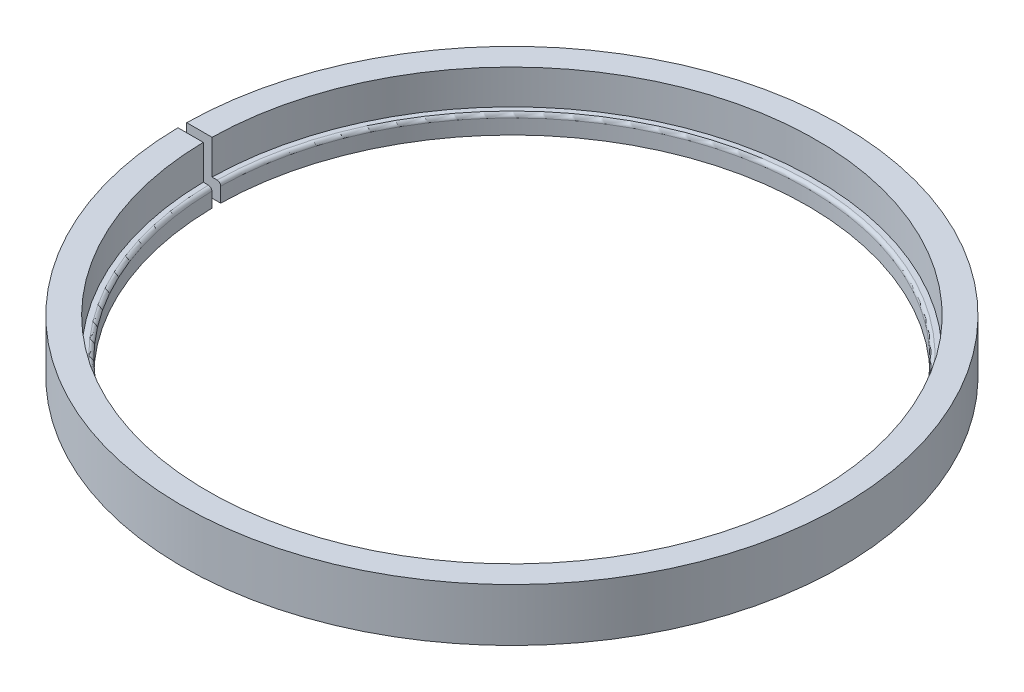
ISO-10303-21;
HEADER;
FILE_DESCRIPTION(('STEP AP214'),'2;1');
FILE_NAME('part.step','',(''),(''),'','','');
FILE_SCHEMA(('AUTOMOTIVE_DESIGN { 1 0 10303 214 1 1 1 1 }'));
ENDSEC;
DATA;
#1=APPLICATION_CONTEXT('core data for automotive mechanical design processes');
#2=APPLICATION_PROTOCOL_DEFINITION('international standard','automotive_design',2000,#1);
#3=PRODUCT_CONTEXT('',#1,'mechanical');
#4=PRODUCT('Part','Part','',(#3));
#5=PRODUCT_RELATED_PRODUCT_CATEGORY('part','',(#4));
#6=PRODUCT_DEFINITION_FORMATION('','',#4);
#7=PRODUCT_DEFINITION_CONTEXT('part definition',#1,'design');
#8=PRODUCT_DEFINITION('design','',#6,#7);
#9=PRODUCT_DEFINITION_SHAPE('','',#8);
#10=(LENGTH_UNIT() NAMED_UNIT(*) SI_UNIT(.MILLI.,.METRE.));
#11=(NAMED_UNIT(*) PLANE_ANGLE_UNIT() SI_UNIT($,.RADIAN.));
#12=(NAMED_UNIT(*) SI_UNIT($,.STERADIAN.) SOLID_ANGLE_UNIT());
#13=UNCERTAINTY_MEASURE_WITH_UNIT(LENGTH_MEASURE(1.E-05),#10,'distance_accuracy_value','');
#14=(GEOMETRIC_REPRESENTATION_CONTEXT(3) GLOBAL_UNCERTAINTY_ASSIGNED_CONTEXT((#13)) GLOBAL_UNIT_ASSIGNED_CONTEXT((#10,
#11,#12)) REPRESENTATION_CONTEXT('',''));
#15=CARTESIAN_POINT('',(0.,0.,0.));
#16=DIRECTION('',(0.,0.,1.));
#17=DIRECTION('',(1.,0.,0.));
#18=AXIS2_PLACEMENT_3D('',#15,#16,#17);
#19=CARTESIAN_POINT('',(0.,0.,0.));
#20=DIRECTION('',(0.,-1.,0.));
#21=DIRECTION('',(0.,0.,-1.));
#22=AXIS2_PLACEMENT_3D('',#19,#20,#21);
#23=CYLINDRICAL_SURFACE('',#22,106.6927);
#24=CARTESIAN_POINT('',(0.,6.09600000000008,0.));
#25=DIRECTION('',(0.,-1.,0.));
#26=DIRECTION('',(0.,0.,-1.));
#27=AXIS2_PLACEMENT_3D('',#24,#25,#26);
#28=CIRCLE('',#27,106.6927);
#29=CARTESIAN_POINT('',(-106.680888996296,6.09600000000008,-1.5875));
#30=VERTEX_POINT('',#29);
#31=CARTESIAN_POINT('',(-106.680888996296,6.09600000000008,1.5875));
#32=VERTEX_POINT('',#31);
#33=EDGE_CURVE('E129',#30,#32,#28,.T.);
#34=ORIENTED_EDGE('',*,*,#33,.T.);
#35=DIRECTION('',(0.,-1.,0.));
#36=VECTOR('',#35,1.);
#37=CARTESIAN_POINT('',(-106.680888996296,0.,1.5875));
#38=LINE('',#37,#36);
#39=CARTESIAN_POINT('',(-106.680888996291,11.4299999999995,1.5875));
#40=VERTEX_POINT('',#39);
#41=EDGE_CURVE('E155',#32,#40,#38,.F.);
#42=ORIENTED_EDGE('',*,*,#41,.T.);
#43=CARTESIAN_POINT('',(0.,11.43,0.));
#44=DIRECTION('',(0.,-1.,0.));
#45=DIRECTION('',(0.,0.,-1.));
#46=AXIS2_PLACEMENT_3D('',#43,#44,#45);
#47=CIRCLE('',#46,106.6927);
#48=CARTESIAN_POINT('',(-106.680888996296,11.43,-1.5875));
#49=VERTEX_POINT('',#48);
#50=EDGE_CURVE('E176',#49,#40,#47,.T.);
#51=ORIENTED_EDGE('',*,*,#50,.F.);
#52=DIRECTION('',(0.,-1.,0.));
#53=VECTOR('',#52,1.);
#54=CARTESIAN_POINT('',(-106.680888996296,0.,-1.5875));
#55=LINE('',#54,#53);
#56=EDGE_CURVE('E53',#49,#30,#55,.T.);
#57=ORIENTED_EDGE('',*,*,#56,.T.);
#58=EDGE_LOOP('',(#34,#42,#51,#57));
#59=FACE_BOUND('',#58,.T.);
#60=ADVANCED_FACE('F35',(#59),#23,.F.);
#61=CARTESIAN_POINT('',(-118.935499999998,6.09600000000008,0.));
#62=DIRECTION('',(0.,1.,0.));
#63=DIRECTION('',(0.,0.,1.));
#64=AXIS2_PLACEMENT_3D('',#61,#62,#63);
#65=PLANE('',#64);
#66=CARTESIAN_POINT('',(0.,6.09600000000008,0.));
#67=DIRECTION('',(0.,-1.,0.));
#68=DIRECTION('',(0.,0.,-1.));
#69=AXIS2_PLACEMENT_3D('',#66,#67,#68);
#70=CIRCLE('',#69,118.935499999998);
#71=CARTESIAN_POINT('',(-118.924904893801,6.09600000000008,-1.5875));
#72=VERTEX_POINT('',#71);
#73=CARTESIAN_POINT('',(-118.924904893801,6.09600000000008,1.5875));
#74=VERTEX_POINT('',#73);
#75=EDGE_CURVE('E121',#72,#74,#70,.T.);
#76=ORIENTED_EDGE('',*,*,#75,.T.);
#77=DIRECTION('',(1.,0.,0.));
#78=VECTOR('',#77,1.);
#79=CARTESIAN_POINT('',(-135.057163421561,6.09600000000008,1.5875));
#80=LINE('',#79,#78);
#81=EDGE_CURVE('E161',#74,#32,#80,.T.);
#82=ORIENTED_EDGE('',*,*,#81,.T.);
#83=ORIENTED_EDGE('',*,*,#33,.F.);
#84=DIRECTION('',(-1.,0.,0.));
#85=VECTOR('',#84,1.);
#86=CARTESIAN_POINT('',(-135.057163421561,6.09600000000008,-1.5875));
#87=LINE('',#86,#85);
#88=EDGE_CURVE('E159',#30,#72,#87,.T.);
#89=ORIENTED_EDGE('',*,*,#88,.T.);
#90=EDGE_LOOP('',(#76,#82,#83,#89));
#91=FACE_BOUND('',#90,.T.);
#92=ADVANCED_FACE('F145',(#91),#65,.F.);
#93=CARTESIAN_POINT('',(0.,0.,0.));
#94=DIRECTION('',(0.,-1.,0.));
#95=DIRECTION('',(0.,0.,-1.));
#96=AXIS2_PLACEMENT_3D('',#93,#94,#95);
#97=CYLINDRICAL_SURFACE('',#96,118.935499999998);
#98=CARTESIAN_POINT('',(0.,25.1460000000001,0.));
#99=DIRECTION('',(0.,-1.,0.));
#100=DIRECTION('',(0.,0.,-1.));
#101=AXIS2_PLACEMENT_3D('',#98,#99,#100);
#102=CIRCLE('',#101,118.935499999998);
#103=CARTESIAN_POINT('',(-118.924904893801,25.1460000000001,-1.5875));
#104=VERTEX_POINT('',#103);
#105=CARTESIAN_POINT('',(-118.924904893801,25.1460000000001,1.5875));
#106=VERTEX_POINT('',#105);
#107=EDGE_CURVE('E113',#104,#106,#102,.T.);
#108=ORIENTED_EDGE('',*,*,#107,.T.);
#109=DIRECTION('',(0.,-1.,0.));
#110=VECTOR('',#109,1.);
#111=CARTESIAN_POINT('',(-118.924904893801,0.,1.5875));
#112=LINE('',#111,#110);
#113=EDGE_CURVE('E174',#106,#74,#112,.T.);
#114=ORIENTED_EDGE('',*,*,#113,.T.);
#115=ORIENTED_EDGE('',*,*,#75,.F.);
#116=DIRECTION('',(0.,-1.,0.));
#117=VECTOR('',#116,1.);
#118=CARTESIAN_POINT('',(-118.924904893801,0.,-1.5875));
#119=LINE('',#118,#117);
#120=EDGE_CURVE('E169',#72,#104,#119,.F.);
#121=ORIENTED_EDGE('',*,*,#120,.T.);
#122=EDGE_LOOP('',(#108,#114,#115,#121));
#123=FACE_BOUND('',#122,.T.);
#124=ADVANCED_FACE('F150',(#123),#97,.T.);
#125=CARTESIAN_POINT('',(-118.935499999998,25.1460000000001,0.));
#126=DIRECTION('',(0.,-1.,0.));
#127=DIRECTION('',(0.,0.,-1.));
#128=AXIS2_PLACEMENT_3D('',#125,#126,#127);
#129=PLANE('',#128);
#130=CARTESIAN_POINT('',(0.,25.1460000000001,0.));
#131=DIRECTION('',(0.,-1.,0.));
#132=DIRECTION('',(0.,0.,-1.));
#133=AXIS2_PLACEMENT_3D('',#130,#131,#132);
#134=CIRCLE('',#133,109.791499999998);
#135=CARTESIAN_POINT('',(-109.780022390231,25.1460000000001,-1.5875));
#136=VERTEX_POINT('',#135);
#137=CARTESIAN_POINT('',(-109.780022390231,25.1460000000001,1.5875));
#138=VERTEX_POINT('',#137);
#139=EDGE_CURVE('E111',#136,#138,#134,.T.);
#140=ORIENTED_EDGE('',*,*,#139,.T.);
#141=DIRECTION('',(1.,0.,0.));
#142=VECTOR('',#141,1.);
#143=CARTESIAN_POINT('',(-135.057163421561,25.1460000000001,1.5875));
#144=LINE('',#143,#142);
#145=EDGE_CURVE('E114',#106,#138,#144,.T.);
#146=ORIENTED_EDGE('',*,*,#145,.F.);
#147=ORIENTED_EDGE('',*,*,#107,.F.);
#148=DIRECTION('',(-1.,0.,0.));
#149=VECTOR('',#148,1.);
#150=CARTESIAN_POINT('',(-135.057163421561,25.1460000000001,-1.5875));
#151=LINE('',#150,#149);
#152=EDGE_CURVE('E97',#136,#104,#151,.T.);
#153=ORIENTED_EDGE('',*,*,#152,.F.);
#154=EDGE_LOOP('',(#140,#146,#147,#153));
#155=FACE_BOUND('',#154,.T.);
#156=ADVANCED_FACE('F109',(#155),#129,.F.);
#157=CARTESIAN_POINT('',(0.,0.,0.));
#158=DIRECTION('',(0.,-1.,0.));
#159=DIRECTION('',(0.,0.,-1.));
#160=AXIS2_PLACEMENT_3D('',#157,#158,#159);
#161=CYLINDRICAL_SURFACE('',#160,109.791499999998);
#162=CARTESIAN_POINT('',(0.,12.7,0.));
#163=DIRECTION('',(0.,-1.,0.));
#164=DIRECTION('',(0.,0.,-1.));
#165=AXIS2_PLACEMENT_3D('',#162,#163,#164);
#166=CIRCLE('',#165,109.791499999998);
#167=CARTESIAN_POINT('',(-109.780022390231,12.7,-1.5875));
#168=VERTEX_POINT('',#167);
#169=CARTESIAN_POINT('',(-109.780022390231,12.7,1.5875));
#170=VERTEX_POINT('',#169);
#171=EDGE_CURVE('E119',#168,#170,#166,.T.);
#172=ORIENTED_EDGE('',*,*,#171,.T.);
#173=DIRECTION('',(0.,-1.,0.));
#174=VECTOR('',#173,1.);
#175=CARTESIAN_POINT('',(-109.780022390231,0.,1.5875));
#176=LINE('',#175,#174);
#177=EDGE_CURVE('E118',#170,#138,#176,.F.);
#178=ORIENTED_EDGE('',*,*,#177,.T.);
#179=ORIENTED_EDGE('',*,*,#139,.F.);
#180=DIRECTION('',(0.,-1.,0.));
#181=VECTOR('',#180,1.);
#182=CARTESIAN_POINT('',(-109.780022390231,0.,-1.5875));
#183=LINE('',#182,#181);
#184=EDGE_CURVE('E94',#136,#168,#183,.T.);
#185=ORIENTED_EDGE('',*,*,#184,.T.);
#186=EDGE_LOOP('',(#172,#178,#179,#185));
#187=FACE_BOUND('',#186,.T.);
#188=ADVANCED_FACE('F117',(#187),#161,.F.);
#189=CARTESIAN_POINT('',(-109.791499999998,12.7,0.));
#190=DIRECTION('',(0.,-1.,0.));
#191=DIRECTION('',(0.,0.,-1.));
#192=AXIS2_PLACEMENT_3D('',#189,#190,#191);
#193=PLANE('',#192);
#194=CARTESIAN_POINT('',(0.,12.7,0.));
#195=DIRECTION('',(0.,-1.,0.));
#196=DIRECTION('',(0.,0.,-1.));
#197=AXIS2_PLACEMENT_3D('',#194,#195,#196);
#198=CIRCLE('',#197,107.9627);
#199=CARTESIAN_POINT('',(-107.951027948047,12.7000000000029,-1.5875));
#200=VERTEX_POINT('',#199);
#201=CARTESIAN_POINT('',(-107.951027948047,12.7,1.5875));
#202=VERTEX_POINT('',#201);
#203=EDGE_CURVE('E123',#200,#202,#198,.T.);
#204=ORIENTED_EDGE('',*,*,#203,.T.);
#205=DIRECTION('',(-1.,0.,0.));
#206=VECTOR('',#205,1.);
#207=CARTESIAN_POINT('',(-109.791499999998,12.7,1.5875));
#208=LINE('',#207,#206);
#209=EDGE_CURVE('E61',#202,#170,#208,.T.);
#210=ORIENTED_EDGE('',*,*,#209,.T.);
#211=ORIENTED_EDGE('',*,*,#171,.F.);
#212=DIRECTION('',(1.,0.,0.));
#213=VECTOR('',#212,1.);
#214=CARTESIAN_POINT('',(-109.791499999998,12.7,-1.5875));
#215=LINE('',#214,#213);
#216=EDGE_CURVE('E100',#168,#200,#215,.T.);
#217=ORIENTED_EDGE('',*,*,#216,.T.);
#218=EDGE_LOOP('',(#204,#210,#211,#217));
#219=FACE_BOUND('',#218,.T.);
#220=ADVANCED_FACE('F180',(#219),#193,.F.);
#221=CARTESIAN_POINT('',(0.,11.43,0.));
#222=DIRECTION('',(0.,-1.,0.));
#223=DIRECTION('',(0.,0.,-1.));
#224=AXIS2_PLACEMENT_3D('',#221,#222,#223);
#225=TOROIDAL_SURFACE('',#224,107.9627,1.27);
#226=ORIENTED_EDGE('',*,*,#50,.T.);
#227=CARTESIAN_POINT('',(-107.397596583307,12.5731011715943,1.5875));
#228=CARTESIAN_POINT('',(-107.461820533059,12.6041848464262,1.5875));
#229=CARTESIAN_POINT('',(-107.528716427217,12.6298672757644,1.5875));
#230=CARTESIAN_POINT('',(-107.665926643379,12.6696563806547,1.5875));
#231=CARTESIAN_POINT('',(-107.736244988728,12.6837490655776,1.5875));
#232=CARTESIAN_POINT('',(-107.878222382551,12.6999210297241,1.5875));
#233=CARTESIAN_POINT('',(-107.949880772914,12.7020060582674,1.5875));
#234=CARTESIAN_POINT('',(-108.09251076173,12.6941150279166,1.5875));
#235=CARTESIAN_POINT('',(-108.163482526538,12.6841419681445,1.5875));
#236=CARTESIAN_POINT('',(-108.302753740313,12.6524220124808,1.5875));
#237=CARTESIAN_POINT('',(-108.371052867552,12.6306737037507,1.5875));
#238=CARTESIAN_POINT('',(-108.503032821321,12.576017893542,1.5875));
#239=CARTESIAN_POINT('',(-108.566713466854,12.5431099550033,1.5875));
#240=CARTESIAN_POINT('',(-108.687641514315,12.467071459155,1.5875));
#241=CARTESIAN_POINT('',(-108.744889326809,12.4239415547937,1.5875));
#242=CARTESIAN_POINT('',(-108.851330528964,12.3286820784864,1.5875));
#243=CARTESIAN_POINT('',(-108.900523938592,12.2765525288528,1.5875));
#244=CARTESIAN_POINT('',(-108.989455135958,12.1647785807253,1.5875));
#245=CARTESIAN_POINT('',(-109.029193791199,12.1051348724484,1.5875));
#246=CARTESIAN_POINT('',(-109.098092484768,11.9800220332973,1.5875));
#247=CARTESIAN_POINT('',(-109.127252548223,11.9145529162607,1.5875));
#248=CARTESIAN_POINT('',(-109.174163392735,11.7796547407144,1.5875));
#249=CARTESIAN_POINT('',(-109.191915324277,11.7102260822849,1.5875));
#250=CARTESIAN_POINT('',(-109.215510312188,11.5693737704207,1.5875));
#251=CARTESIAN_POINT('',(-109.22135336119,11.4979501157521,1.5875));
#252=CARTESIAN_POINT('',(-109.220964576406,11.355140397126,1.5875));
#253=CARTESIAN_POINT('',(-109.214733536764,11.2837543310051,1.5875));
#254=CARTESIAN_POINT('',(-109.190375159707,11.1430415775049,1.5875));
#255=CARTESIAN_POINT('',(-109.172247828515,11.0737148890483,1.5875));
#256=CARTESIAN_POINT('',(-109.124611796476,10.9390888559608,1.5875));
#257=CARTESIAN_POINT('',(-109.095103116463,10.8737895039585,1.5875));
#258=CARTESIAN_POINT('',(-109.025542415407,10.7490712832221,1.5875));
#259=CARTESIAN_POINT('',(-108.985490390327,10.6896524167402,1.5875));
#260=CARTESIAN_POINT('',(-108.895977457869,10.5783778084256,1.5875));
#261=CARTESIAN_POINT('',(-108.846515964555,10.5265225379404,1.5875));
#262=CARTESIAN_POINT('',(-108.739590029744,10.431850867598,1.5875));
#263=CARTESIAN_POINT('',(-108.68212558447,10.3890344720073,1.5875));
#264=CARTESIAN_POINT('',(-108.560818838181,10.3136513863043,1.5875));
#265=CARTESIAN_POINT('',(-108.496975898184,10.2810857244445,1.5875));
#266=CARTESIAN_POINT('',(-108.364729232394,10.2271337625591,1.5875));
#267=CARTESIAN_POINT('',(-108.29632550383,10.2057474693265,1.5875));
#268=CARTESIAN_POINT('',(-108.156892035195,10.1747593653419,1.5875));
#269=CARTESIAN_POINT('',(-108.085862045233,10.1651586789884,1.5875));
#270=CARTESIAN_POINT('',(-107.943198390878,10.1580178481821,1.5875));
#271=CARTESIAN_POINT('',(-107.871564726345,10.1604777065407,1.5875));
#272=CARTESIAN_POINT('',(-107.72972350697,10.1773885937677,1.5875));
#273=CARTESIAN_POINT('',(-107.659516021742,10.19184020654,1.5875));
#274=CARTESIAN_POINT('',(-107.522523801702,10.2323253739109,1.5875));
#275=CARTESIAN_POINT('',(-107.455739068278,10.2583589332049,1.5875));
#276=CARTESIAN_POINT('',(-107.3274897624,10.321268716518,1.5875));
#277=CARTESIAN_POINT('',(-107.266025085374,10.358144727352,1.5875));
#278=CARTESIAN_POINT('',(-107.150159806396,10.4416931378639,1.5875));
#279=CARTESIAN_POINT('',(-107.09575919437,10.4883655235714,1.5875));
#280=CARTESIAN_POINT('',(-106.995571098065,10.5901778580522,1.5875));
#281=CARTESIAN_POINT('',(-106.949782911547,10.6453171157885,1.5875));
#282=CARTESIAN_POINT('',(-106.868114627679,10.7625009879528,1.5875));
#283=CARTESIAN_POINT('',(-106.832234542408,10.8245456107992,1.5875));
#284=CARTESIAN_POINT('',(-106.771405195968,10.9537716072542,1.5875));
#285=CARTESIAN_POINT('',(-106.746454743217,11.0209524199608,1.5875));
#286=CARTESIAN_POINT('',(-106.708187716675,11.1585496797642,1.5875));
#287=CARTESIAN_POINT('',(-106.694871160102,11.2289661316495,1.5875));
#288=CARTESIAN_POINT('',(-106.680250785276,11.3710304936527,1.5875));
#289=CARTESIAN_POINT('',(-106.67894616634,11.4426783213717,1.5875));
#290=CARTESIAN_POINT('',(-106.688384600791,11.585173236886,1.5875));
#291=CARTESIAN_POINT('',(-106.699127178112,11.6560203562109,1.5875));
#292=CARTESIAN_POINT('',(-106.732351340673,11.7948962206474,1.5875));
#293=CARTESIAN_POINT('',(-106.754831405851,11.8629253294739,1.5875));
#294=CARTESIAN_POINT('',(-106.810900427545,11.9942621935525,1.5875));
#295=CARTESIAN_POINT('',(-106.844492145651,12.0575687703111,1.5875));
#296=CARTESIAN_POINT('',(-106.921841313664,12.1776714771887,1.5875));
#297=CARTESIAN_POINT('',(-106.965604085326,12.2344641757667,1.5875));
#298=CARTESIAN_POINT('',(-107.062013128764,12.3398420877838,1.5875));
#299=CARTESIAN_POINT('',(-107.114648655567,12.3884370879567,1.5875));
#300=CARTESIAN_POINT('',(-107.20611707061,12.4596212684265,1.5875));
#301=CARTESIAN_POINT('',(-107.242720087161,12.485127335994,1.5875));
#302=CARTESIAN_POINT('',(-107.318400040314,12.5321585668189,1.5875));
#303=CARTESIAN_POINT('',(-107.357476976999,12.5536837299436,1.5875));
#304=CARTESIAN_POINT('',(-107.397596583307,12.5731011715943,1.5875));
#305=B_SPLINE_CURVE_WITH_KNOTS('',3,(#227,#228,#229,#230,#231,#232,#233,#234,#235,#236,#237,
#238,#239,#240,#241,#242,#243,#244,#245,#246,#247,#248,#249,#250,#251,#252,#253,#254,#255,#256,
#257,#258,#259,#260,#261,#262,#263,#264,#265,#266,#267,#268,#269,#270,#271,#272,#273,#274,#275,
#276,#277,#278,#279,#280,#281,#282,#283,#284,#285,#286,#287,#288,#289,#290,#291,#292,#293,#294,
#295,#296,#297,#298,#299,#300,#301,#302,#303,#304),.UNSPECIFIED.,.T.,.F.,(4,2,2,2,2,2,2,2,2,2,2,
2,2,2,2,2,2,2,2,2,2,2,2,2,2,2,2,2,2,2,2,2,2,2,2,2,2,2,4),(0.,0.213889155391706,
0.428036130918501,0.642080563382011,0.856071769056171,1.07008865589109,1.28411392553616,
1.49812552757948,1.71213659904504,1.92612802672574,2.14011894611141,2.35408828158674,
2.56805774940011,2.78201314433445,2.99596842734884,3.20992331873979,3.42387829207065,
3.63784659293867,3.8518149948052,4.06580485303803,4.27979484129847,4.49380524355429,
4.70781569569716,4.92183656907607,5.13585752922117,5.3498742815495,5.56389072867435,
5.77788971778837,5.99188896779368,6.20586488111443,6.41984111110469,6.63380307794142,
6.84775659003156,7.06168240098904,7.27566141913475,7.48975264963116,7.7035864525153,
7.83719935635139,7.97081226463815),.UNSPECIFIED.);
#306=EDGE_CURVE('E11',#40,#202,#305,.T.);
#307=ORIENTED_EDGE('',*,*,#306,.T.);
#308=ORIENTED_EDGE('',*,*,#203,.F.);
#309=CARTESIAN_POINT('',(-107.397596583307,12.5731011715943,-1.5875));
#310=CARTESIAN_POINT('',(-107.333383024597,12.5420154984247,-1.5875));
#311=CARTESIAN_POINT('',(-107.271747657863,12.505484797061,-1.5875));
#312=CARTESIAN_POINT('',(-107.155434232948,12.4225626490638,-1.5875));
#313=CARTESIAN_POINT('',(-107.100764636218,12.3761593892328,-1.5875));
#314=CARTESIAN_POINT('',(-107.000014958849,12.2748490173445,-1.5875));
#315=CARTESIAN_POINT('',(-106.953930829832,12.2199459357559,-1.5875));
#316=CARTESIAN_POINT('',(-106.871648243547,12.1031963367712,-1.5875));
#317=CARTESIAN_POINT('',(-106.835447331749,12.041351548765,-1.5875));
#318=CARTESIAN_POINT('',(-106.773940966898,11.9124601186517,-1.5875));
#319=CARTESIAN_POINT('',(-106.748635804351,11.8454133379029,-1.5875));
#320=CARTESIAN_POINT('',(-106.709641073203,11.7080202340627,-1.5875));
#321=CARTESIAN_POINT('',(-106.695951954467,11.6376737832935,-1.5875));
#322=CARTESIAN_POINT('',(-106.680580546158,11.4956885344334,-1.5875));
#323=CARTESIAN_POINT('',(-106.678897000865,11.4240498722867,-1.5875));
#324=CARTESIAN_POINT('',(-106.687581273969,11.281506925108,-1.5875));
#325=CARTESIAN_POINT('',(-106.697949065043,11.2106026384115,-1.5875));
#326=CARTESIAN_POINT('',(-106.730441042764,11.0715427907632,-1.5875));
#327=CARTESIAN_POINT('',(-106.752564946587,11.0033871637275,-1.5875));
#328=CARTESIAN_POINT('',(-106.80794054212,10.8717574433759,-1.5875));
#329=CARTESIAN_POINT('',(-106.841192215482,10.8082833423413,-1.5875));
#330=CARTESIAN_POINT('',(-106.917880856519,10.687815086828,-1.5875));
#331=CARTESIAN_POINT('',(-106.961318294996,10.6308212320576,-1.5875));
#332=CARTESIAN_POINT('',(-107.057144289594,10.5249340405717,-1.5875));
#333=CARTESIAN_POINT('',(-107.109532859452,10.4760407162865,-1.5875));
#334=CARTESIAN_POINT('',(-107.221779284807,10.3877374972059,-1.5875));
#335=CARTESIAN_POINT('',(-107.281637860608,10.3483285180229,-1.5875));
#336=CARTESIAN_POINT('',(-107.407121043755,10.2801181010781,-1.5875));
#337=CARTESIAN_POINT('',(-107.472745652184,10.2513166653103,-1.5875));
#338=CARTESIAN_POINT('',(-107.607905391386,10.2051358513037,-1.5875));
#339=CARTESIAN_POINT('',(-107.677440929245,10.1877576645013,-1.5875));
#340=CARTESIAN_POINT('',(-107.818442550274,10.1649211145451,-1.5875));
#341=CARTESIAN_POINT('',(-107.889908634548,10.1594627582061,-1.5875));
#342=CARTESIAN_POINT('',(-108.032747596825,10.1606207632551,-1.5875));
#343=CARTESIAN_POINT('',(-108.104120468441,10.1672379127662,-1.5875));
#344=CARTESIAN_POINT('',(-108.244742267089,10.1923607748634,-1.5875));
#345=CARTESIAN_POINT('',(-108.313991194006,10.2108664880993,-1.5875));
#346=CARTESIAN_POINT('',(-108.448399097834,10.2592414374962,-1.5875));
#347=CARTESIAN_POINT('',(-108.513558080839,10.2891106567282,-1.5875));
#348=CARTESIAN_POINT('',(-108.637936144,10.3593651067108,-1.5875));
#349=CARTESIAN_POINT('',(-108.697155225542,10.3997503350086,-1.5875));
#350=CARTESIAN_POINT('',(-108.807968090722,10.4898876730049,-1.5875));
#351=CARTESIAN_POINT('',(-108.859562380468,10.5396391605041,-1.5875));
#352=CARTESIAN_POINT('',(-108.953665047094,10.6470987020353,-1.5875));
#353=CARTESIAN_POINT('',(-108.996173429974,10.7048067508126,-1.5875));
#354=CARTESIAN_POINT('',(-109.070892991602,10.8265349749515,-1.5875));
#355=CARTESIAN_POINT('',(-109.103105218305,10.8905545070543,-1.5875));
#356=CARTESIAN_POINT('',(-109.156323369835,11.023093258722,-1.5875));
#357=CARTESIAN_POINT('',(-109.177329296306,11.0916124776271,-1.5875));
#358=CARTESIAN_POINT('',(-109.207536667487,11.2311987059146,-1.5875));
#359=CARTESIAN_POINT('',(-109.216739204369,11.3022654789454,-1.5875));
#360=CARTESIAN_POINT('',(-109.223081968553,11.4449352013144,-1.5875));
#361=CARTESIAN_POINT('',(-109.22022221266,11.5165381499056,-1.5875));
#362=CARTESIAN_POINT('',(-109.202522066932,11.6582443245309,-1.5875));
#363=CARTESIAN_POINT('',(-109.187682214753,11.7283476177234,-1.5875));
#364=CARTESIAN_POINT('',(-109.14644402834,11.8650680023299,-1.5875));
#365=CARTESIAN_POINT('',(-109.12004567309,11.9316850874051,-1.5875));
#366=CARTESIAN_POINT('',(-109.056439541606,12.0595434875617,-1.5875));
#367=CARTESIAN_POINT('',(-109.019231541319,12.1207846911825,-1.5875));
#368=CARTESIAN_POINT('',(-108.935062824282,12.2361519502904,-1.5875));
#369=CARTESIAN_POINT('',(-108.888102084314,12.2902779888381,-1.5875));
#370=CARTESIAN_POINT('',(-108.785756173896,12.3898839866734,-1.5875));
#371=CARTESIAN_POINT('',(-108.73037017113,12.4353630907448,-1.5875));
#372=CARTESIAN_POINT('',(-108.612751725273,12.5163765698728,-1.5875));
#373=CARTESIAN_POINT('',(-108.550519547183,12.5519113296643,-1.5875));
#374=CARTESIAN_POINT('',(-108.420974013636,12.6120307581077,-1.5875));
#375=CARTESIAN_POINT('',(-108.353660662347,12.6366154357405,-1.5875));
#376=CARTESIAN_POINT('',(-108.215843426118,12.6741413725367,-1.5875));
#377=CARTESIAN_POINT('',(-108.145338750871,12.6870797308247,-1.5875));
#378=CARTESIAN_POINT('',(-108.003124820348,12.7009424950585,-1.5875));
#379=CARTESIAN_POINT('',(-107.931414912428,12.7018601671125,-1.5875));
#380=CARTESIAN_POINT('',(-107.78892015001,12.6916324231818,-1.5875));
#381=CARTESIAN_POINT('',(-107.718134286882,12.6805015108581,-1.5875));
#382=CARTESIAN_POINT('',(-107.605513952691,12.6529225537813,-1.5875));
#383=CARTESIAN_POINT('',(-107.562775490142,12.640032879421,-1.5875));
#384=CARTESIAN_POINT('',(-107.478887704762,12.6098384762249,-1.5875));
#385=CARTESIAN_POINT('',(-107.437738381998,12.5925337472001,-1.5875));
#386=CARTESIAN_POINT('',(-107.397596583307,12.5731011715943,-1.5875));
#387=B_SPLINE_CURVE_WITH_KNOTS('',3,(#309,#310,#311,#312,#313,#314,#315,#316,#317,#318,#319,
#320,#321,#322,#323,#324,#325,#326,#327,#328,#329,#330,#331,#332,#333,#334,#335,#336,#337,#338,
#339,#340,#341,#342,#343,#344,#345,#346,#347,#348,#349,#350,#351,#352,#353,#354,#355,#356,#357,
#358,#359,#360,#361,#362,#363,#364,#365,#366,#367,#368,#369,#370,#371,#372,#373,#374,#375,#376,
#377,#378,#379,#380,#381,#382,#383,#384,#385,#386),.UNSPECIFIED.,.T.,.F.,(4,2,2,2,2,2,2,2,2,2,2,
2,2,2,2,2,2,2,2,2,2,2,2,2,2,2,2,2,2,2,2,2,2,2,2,2,2,2,4),(0.,0.213863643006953,
0.427984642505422,0.642004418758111,0.855970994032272,1.06994327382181,1.28392383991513,
1.49788202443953,1.71183972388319,1.9257922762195,2.13974447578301,2.35370656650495,
2.56766898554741,2.78165205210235,2.99563515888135,3.20964058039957,3.42364612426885,
3.63766563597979,3.85168515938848,4.06570436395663,4.27972351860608,4.49372846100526,
4.70773326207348,4.92171627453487,5.13569925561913,5.34966243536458,5.56362531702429,
5.77757859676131,5.99153226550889,6.20549036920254,6.41944898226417,6.63342874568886,
6.84740022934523,7.06137153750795,7.27539612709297,7.48954060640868,7.70342759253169,
7.83712008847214,7.97081259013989),.UNSPECIFIED.);
#388=EDGE_CURVE('E46',#200,#49,#387,.T.);
#389=ORIENTED_EDGE('',*,*,#388,.T.);
#390=EDGE_LOOP('',(#226,#307,#308,#389));
#391=FACE_BOUND('',#390,.T.);
#392=ADVANCED_FACE('F134',(#391),#225,.T.);
#393=CARTESIAN_POINT('',(-135.057163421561,6.09600000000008,-1.5875));
#394=DIRECTION('',(0.,0.,-1.));
#395=DIRECTION('',(-1.,0.,0.));
#396=AXIS2_PLACEMENT_3D('',#393,#394,#395);
#397=PLANE('',#396);
#398=ORIENTED_EDGE('',*,*,#88,.F.);
#399=ORIENTED_EDGE('',*,*,#56,.F.);
#400=ORIENTED_EDGE('',*,*,#388,.F.);
#401=ORIENTED_EDGE('',*,*,#216,.F.);
#402=ORIENTED_EDGE('',*,*,#184,.F.);
#403=ORIENTED_EDGE('',*,*,#152,.T.);
#404=ORIENTED_EDGE('',*,*,#120,.F.);
#405=EDGE_LOOP('',(#398,#399,#400,#401,#402,#403,#404));
#406=FACE_BOUND('',#405,.T.);
#407=ADVANCED_FACE('F96',(#406),#397,.F.);
#408=CARTESIAN_POINT('',(-135.057163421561,6.09600000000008,1.5875));
#409=DIRECTION('',(0.,0.,1.));
#410=DIRECTION('',(1.,0.,0.));
#411=AXIS2_PLACEMENT_3D('',#408,#409,#410);
#412=PLANE('',#411);
#413=ORIENTED_EDGE('',*,*,#145,.T.);
#414=ORIENTED_EDGE('',*,*,#177,.F.);
#415=ORIENTED_EDGE('',*,*,#209,.F.);
#416=ORIENTED_EDGE('',*,*,#306,.F.);
#417=ORIENTED_EDGE('',*,*,#41,.F.);
#418=ORIENTED_EDGE('',*,*,#81,.F.);
#419=ORIENTED_EDGE('',*,*,#113,.F.);
#420=EDGE_LOOP('',(#413,#414,#415,#416,#417,#418,#419));
#421=FACE_BOUND('',#420,.T.);
#422=ADVANCED_FACE('F139',(#421),#412,.F.);
#423=CLOSED_SHELL('',(#60,#92,#124,#156,#188,#220,#392,#407,#422));
#424=MANIFOLD_SOLID_BREP('B2',#423);
#425=ADVANCED_BREP_SHAPE_REPRESENTATION('',(#18,#424),#14);
#426=SHAPE_DEFINITION_REPRESENTATION(#9,#425);
ENDSEC;
END-ISO-10303-21;
